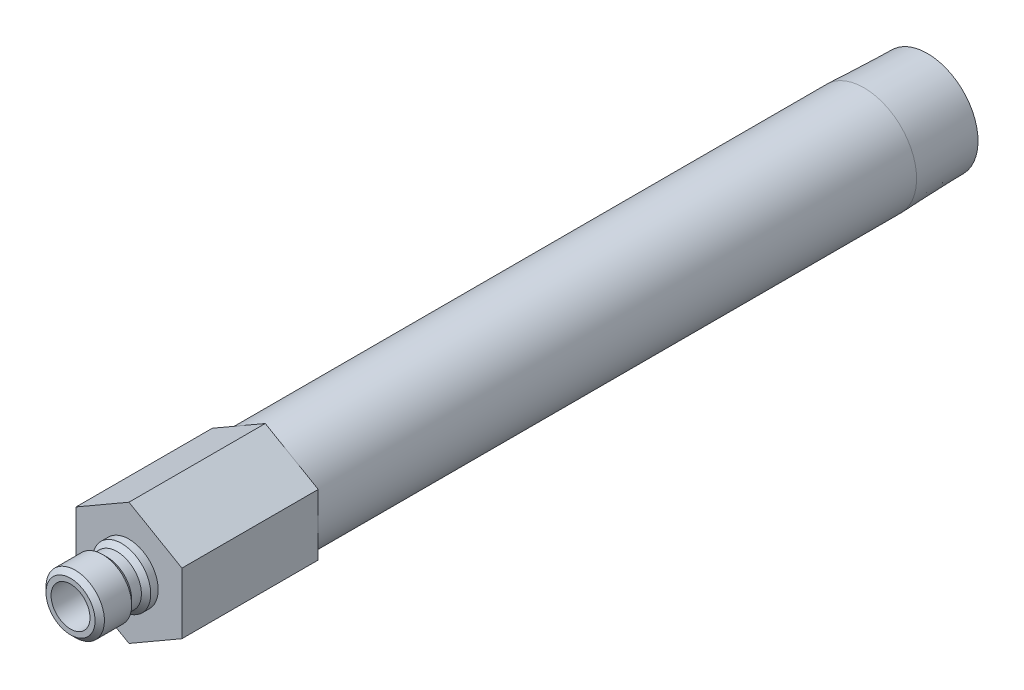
from build123d import *

# Parameters (mm, degrees)
SKETCH2_R           = 3.175
BOSS_EXTRUDE1_DEPTH = 22.225


with BuildPart() as part:
    # Sketch1 → Revolve1 (revolve)
    with BuildSketch(Plane(origin=(0, 0, 0), x_dir=(0, 0, -1), z_dir=(1, 0, 0))):
        Polygon((-9.525, 3.175), (-9.525, 4.0005), (-8.763, 4.7625), (-4.318, 4.7625), (-3.556, 4.0005), (-1.9685, 4.0005), (-1.2065, 4.7625), (0, 4.7625), (0, 8.5725), (119.8372, 8.5725), (130.175, 8.249445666), (130.175, 6.2611), (22.225, 6.2611), (22.225, 3.175), align=None)
    revolve(axis=Axis((0, 0, 0), (0, 0, 1)))

    # Sketch2 → Boss-Extrude1 (add)
    with BuildSketch(Plane.XY):
        Polygon((-8.636, 4.985996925), (-8.636, -4.985996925), (0, -9.971993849), (8.636, -4.985996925), (8.636, 4.985996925), (0, 9.971993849), align=None)
        with Locations(Location((0, 0, 0), (0, 0, 90))):
            Circle(SKETCH2_R, mode=Mode.SUBTRACT)
    extrude(amount=-BOSS_EXTRUDE1_DEPTH)


solid = part.part
